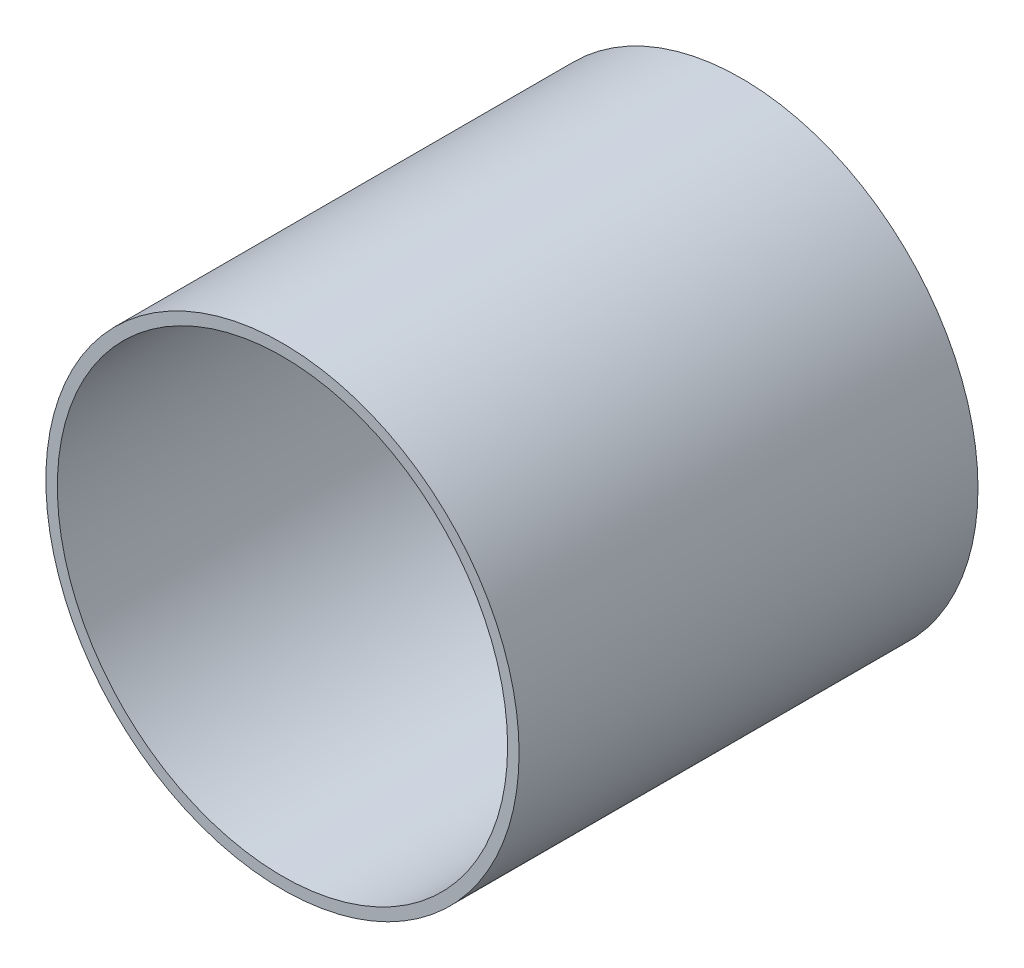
from build123d import *

# Parameters (mm, degrees)
ESQUISSE1_R        = 82.5
ESQUISSE1_R_2      = 78.5
BOSS_EXTRU_1_DEPTH = 160


with BuildPart() as part:
    # Esquisse1 → Boss.-Extru.1 (new body)
    with BuildSketch(Plane.XY):
        Circle(ESQUISSE1_R)
        Circle(ESQUISSE1_R_2, mode=Mode.SUBTRACT)
    extrude(amount=BOSS_EXTRU_1_DEPTH)


solid = part.part
